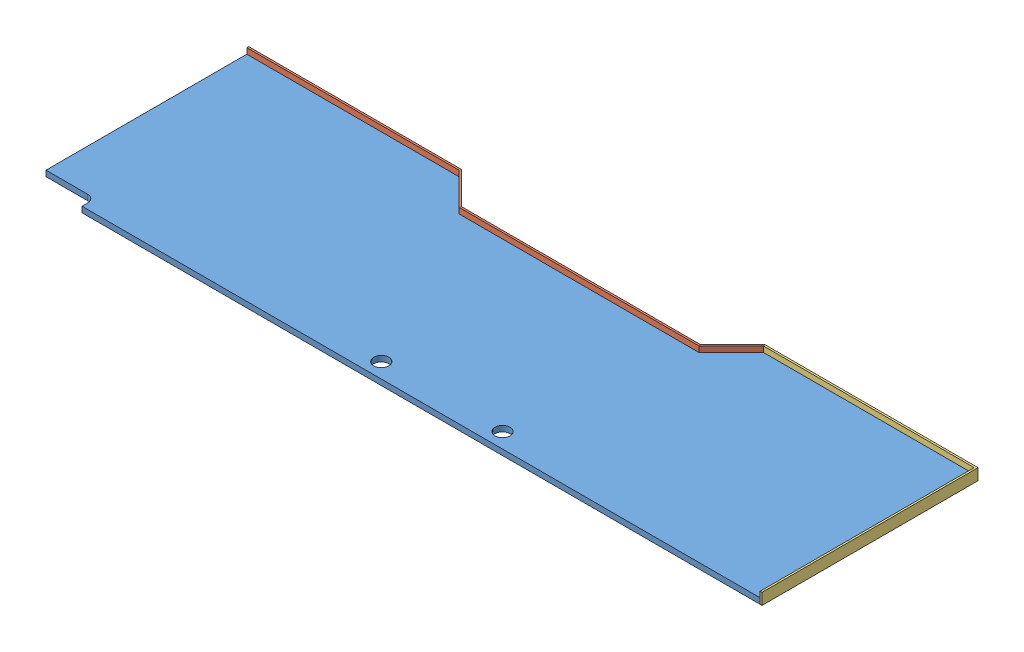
SolidWorks assembly Assem2.sldasm, configuration Default (file format 11000). Lengths in mm.
Overall size (2444.75 38.1 723.9).
3 component instances, 3 part files, 6 mates.
Components (placement in the parent):
- miniROV Table-1: miniROV Table.SLDPRT [Default] at (0.67 -11.2837 0) size (2438.4 19.05 717.55)
- Front Trim of Mini ROV Table-1: Front Trim of Mini ROV Table.SLDPRT [Default] at (3.3002 -11.2837 -257.175) x (-1 0 0) z (0 0 1) size (1732.37 38.1 114.3)
- MiniROV Table Side Trim-1: MiniROV Table Side Trim.SLDPRT [Default] at (1219.87 26.8163 358.775) x (1 0 0) z (0 0 -1) size (714.98 38.1 723.9)
Mates (geometry in assembly coordinates):
- Coincident11: coincident: plane of miniROV Table-1 through (-1078.83 -11.2837 339.725) normal (0 -1 0); plane of Front Trim of Mini ROV Table-1 through (515.7904 -11.2837 -360.6349) normal (0 -1 0)
- Coincident12: coincident: plane of miniROV Table-1 through (-1218.53 7.7663 -358.775) normal (0 0 -1); plane of Front Trim of Mini ROV Table-1 through (-504.6998 -11.2837 -358.775) normal (0 0 1)
- Coincident13: coincident: plane of miniROV Table-1 through (-507.33 7.7663 -358.775) normal (0.707107 0 -0.707107); plane of Front Trim of Mini ROV Table-1 through (-399.1233 -11.2837 -250.5683) normal (-0.707107 0 0.707107)
- Coincident17: coincident: plane of miniROV Table-1 through (508.67 7.7663 -358.775) normal (0 0 -1); plane of MiniROV Table Side Trim-1 through (508.67 26.8163 -358.775) normal (0 0 1)
- Coincident18: coincident: plane of miniROV Table-1 through (1219.87 7.7663 -358.775) normal (1 0 0); plane of MiniROV Table Side Trim-1 through (1219.87 -11.2837 -358.775) normal (-1 0 0)
- Coincident19: coincident: plane of miniROV Table-1 through (-1078.83 -11.2837 339.725) normal (0 -1 0); plane of MiniROV Table Side Trim-1 through (1219.87 -11.2837 -358.775) normal (0 -1 0)
